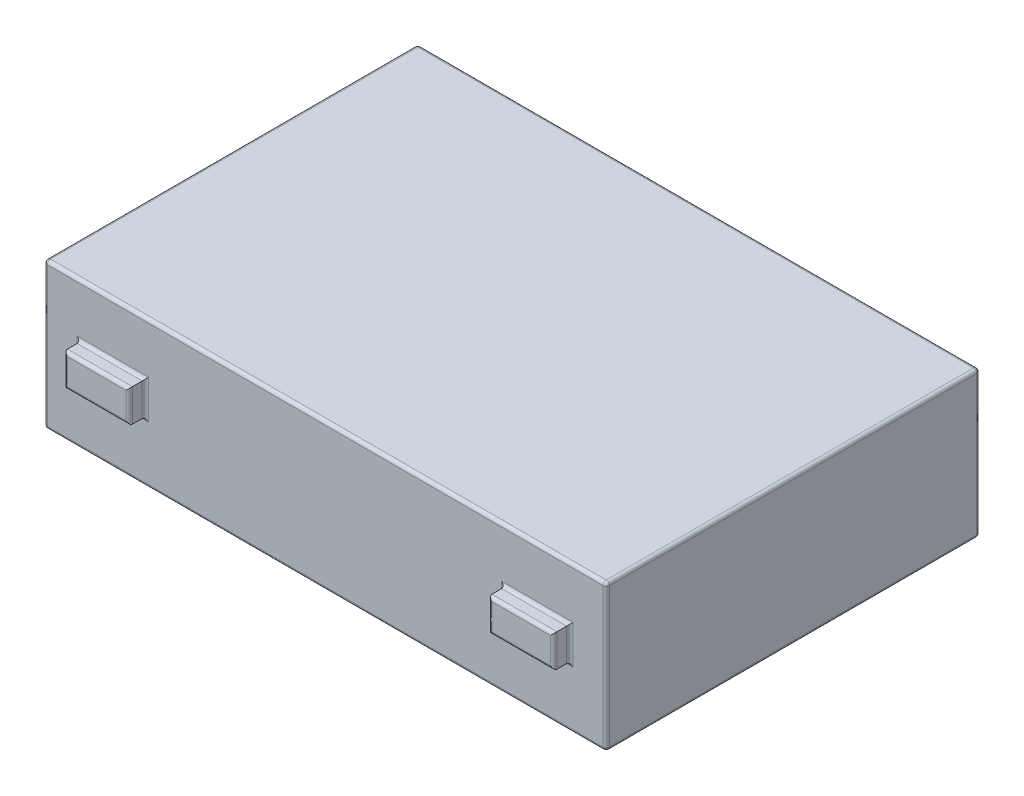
from build123d import *

# Parameters (mm, degrees)
SKETCH1_W           = 173
SKETCH1_H           = 45
BOSS_EXTRUDE1_DEPTH = 115
SKETCH2_W           = 20
SKETCH2_H           = 10
BOSS_EXTRUDE2_DEPTH = 5
FILLET1_R           = 1


with BuildPart() as part:
    # Sketch1 → Boss-Extrude1 (new body)
    with BuildSketch(Plane.XY):
        Rectangle(SKETCH1_W, SKETCH1_H)
    extrude(amount=BOSS_EXTRUDE1_DEPTH)

    # Sketch2 → Boss-Extrude2 (add)
    with BuildSketch(Plane.XY.offset(115)):
        with Locations((-65.318867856, 1.117777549)):
            Rectangle(SKETCH2_W, SKETCH2_H)
        with Locations((65.318867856, 1.117777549)):
            Rectangle(SKETCH2_W, SKETCH2_H)
    extrude(amount=BOSS_EXTRUDE2_DEPTH)

    # Fillet1
    fillet1_edges = [part.edges().sort_by_distance(p)[0] for p in [
        (-86.5, 0, 115),
        (0, -22.5, 115),
        (-75.318867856, 1.117777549, 115),
        (-65.318867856, -3.882222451, 115),
        (-55.318867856, 1.117777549, 115),
        (-65.318867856, 6.117777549, 115),
        (-75.318867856, 1.117777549, 120),
        (-65.318867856, -3.882222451, 120),
        (-55.318867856, 1.117777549, 120),
        (-65.318867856, 6.117777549, 120),
        (75.318867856, 1.117777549, 115),
        (65.318867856, 6.117777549, 115),
        (55.318867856, 1.117777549, 115),
        (65.318867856, -3.882222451, 115),
        (75.318867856, 1.117777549, 120),
        (65.318867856, 6.117777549, 120),
        (55.318867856, 1.117777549, 120),
        (65.318867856, -3.882222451, 120),
        (86.5, 0, 115),
        (0, -22.5, 0),
        (-86.5, 0, 0),
        (0, 22.5, 0),
        (86.5, 0, 0),
        (86.5, -22.5, 57.5),
        (-86.5, -22.5, 57.5),
        (-86.5, 22.5, 57.5),
        (86.5, 22.5, 57.5),
        (0, 22.5, 115),
    ]]
    fillet(fillet1_edges, radius=FILLET1_R)


solid = part.part
